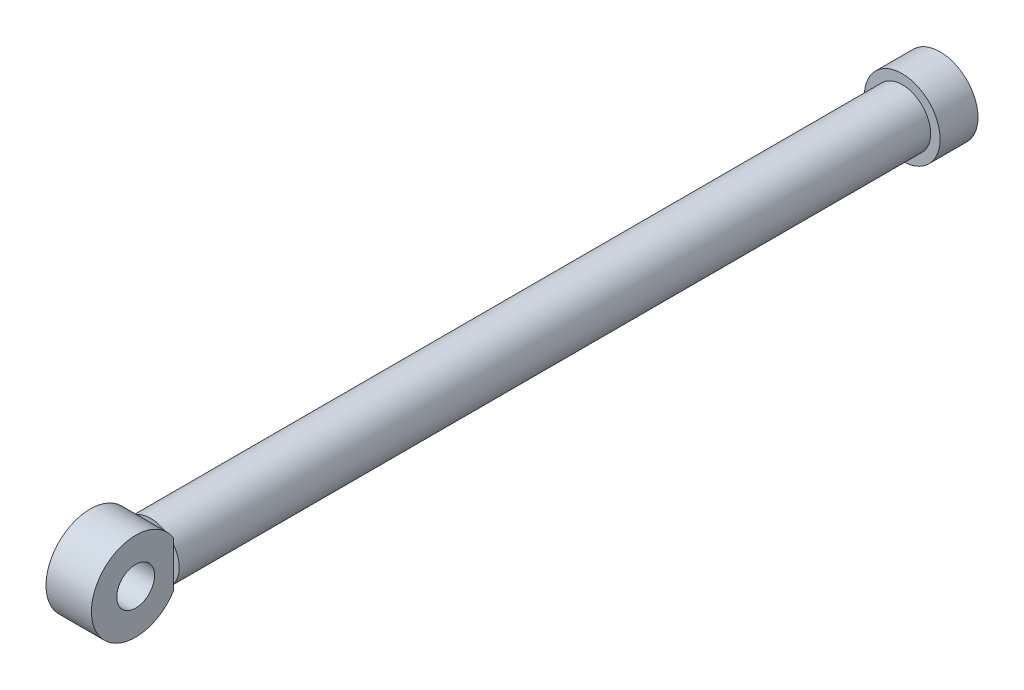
from build123d import *

# Parameters (mm, degrees)
SKETCH_1_R      = 30
EXTRUDE_1_DEPTH = 30
SKETCH_2_R      = 22.5
EXTRUDE_2_DEPTH = 595
SKETCH_4_R      = 15
EXTRUDE_3_DEPTH = 18


with BuildPart() as part:
    # Sketch 1 → Extrude 1 (new body)
    with BuildSketch(Plane.XY):
        Circle(SKETCH_1_R)
    extrude(amount=EXTRUDE_1_DEPTH)

    # Sketch 2 → Extrude 2 (add)
    with BuildSketch(Plane.XY.offset(30)):
        Circle(SKETCH_2_R)
    extrude(amount=EXTRUDE_2_DEPTH)

    # Sketch 4 → Extrude 3 (add, symmetric)
    with BuildSketch(Plane(origin=(0, 0, 0), x_dir=(0, 0, -1), z_dir=(1, 0, 0))):
        with BuildLine():
            Line((-625, 18.027756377), (-625, -18.027756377))
            ThreePointArc((-625, -18.027756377), (-690, 0), (-625, 18.027756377))
        make_face()
        with Locations((-655, 0)):
            Circle(SKETCH_4_R, mode=Mode.SUBTRACT)
    extrude(amount=EXTRUDE_3_DEPTH, both=True)


solid = part.part
